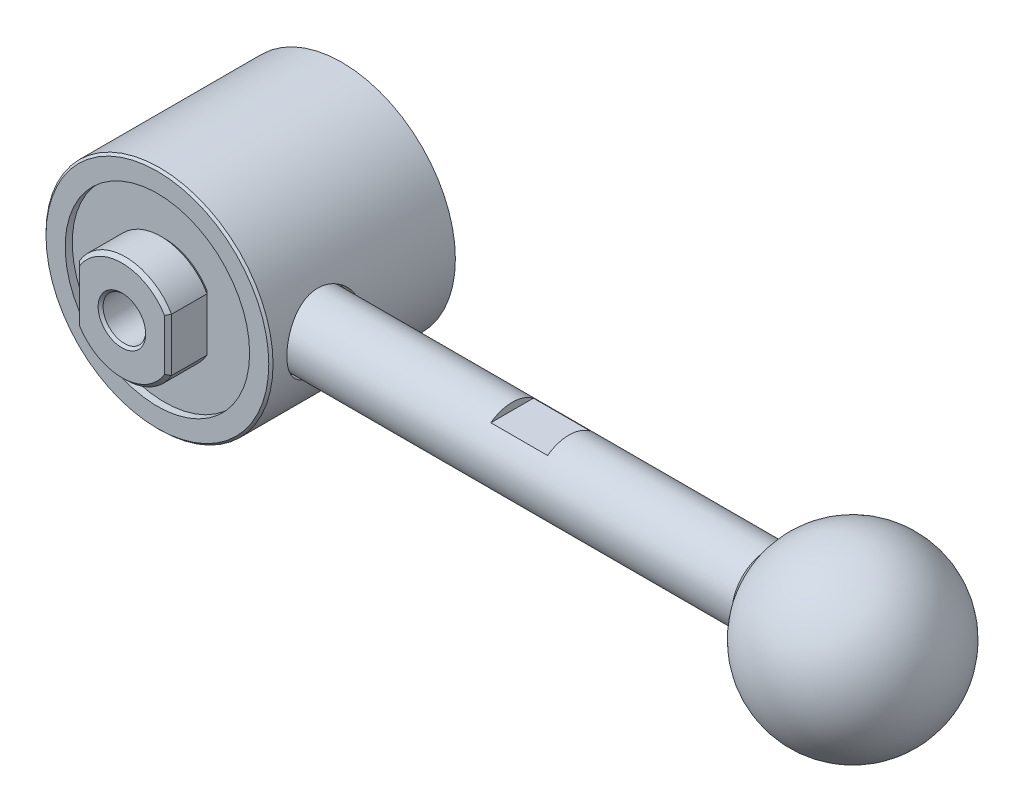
ISO-10303-21;
HEADER;
FILE_DESCRIPTION(('STEP AP214'),'2;1');
FILE_NAME('part.step','',(''),(''),'','','');
FILE_SCHEMA(('AUTOMOTIVE_DESIGN { 1 0 10303 214 1 1 1 1 }'));
ENDSEC;
DATA;
#1=APPLICATION_CONTEXT('core data for automotive mechanical design processes');
#2=APPLICATION_PROTOCOL_DEFINITION('international standard','automotive_design',2000,#1);
#3=PRODUCT_CONTEXT('',#1,'mechanical');
#4=PRODUCT('Part','Part','',(#3));
#5=PRODUCT_RELATED_PRODUCT_CATEGORY('part','',(#4));
#6=PRODUCT_DEFINITION_FORMATION('','',#4);
#7=PRODUCT_DEFINITION_CONTEXT('part definition',#1,'design');
#8=PRODUCT_DEFINITION('design','',#6,#7);
#9=PRODUCT_DEFINITION_SHAPE('','',#8);
#10=(LENGTH_UNIT() NAMED_UNIT(*) SI_UNIT(.MILLI.,.METRE.));
#11=(NAMED_UNIT(*) PLANE_ANGLE_UNIT() SI_UNIT($,.RADIAN.));
#12=(NAMED_UNIT(*) SI_UNIT($,.STERADIAN.) SOLID_ANGLE_UNIT());
#13=UNCERTAINTY_MEASURE_WITH_UNIT(LENGTH_MEASURE(1.E-05),#10,'distance_accuracy_value','');
#14=(GEOMETRIC_REPRESENTATION_CONTEXT(3) GLOBAL_UNCERTAINTY_ASSIGNED_CONTEXT((#13)) GLOBAL_UNIT_ASSIGNED_CONTEXT((#10,
#11,#12)) REPRESENTATION_CONTEXT('',''));
#15=CARTESIAN_POINT('',(0.,0.,0.));
#16=DIRECTION('',(0.,0.,1.));
#17=DIRECTION('',(1.,0.,0.));
#18=AXIS2_PLACEMENT_3D('',#15,#16,#17);
#19=CARTESIAN_POINT('',(0.,0.,3.5));
#20=DIRECTION('',(0.,0.,1.));
#21=DIRECTION('',(0.,1.,0.));
#22=AXIS2_PLACEMENT_3D('',#19,#20,#21);
#23=CYLINDRICAL_SURFACE('',#22,8.);
#24=CARTESIAN_POINT('',(0.,0.,13.5));
#25=DIRECTION('',(0.,0.,1.));
#26=DIRECTION('',(0.,1.,0.));
#27=AXIS2_PLACEMENT_3D('',#24,#25,#26);
#28=CIRCLE('',#27,8.);
#29=CARTESIAN_POINT('',(0.,8.,13.5));
#30=VERTEX_POINT('',#29);
#31=EDGE_CURVE('E331',#30,#30,#28,.T.);
#32=ORIENTED_EDGE('',*,*,#31,.T.);
#33=EDGE_LOOP('',(#32));
#34=FACE_BOUND('',#33,.T.);
#35=CARTESIAN_POINT('',(0.,0.,13.));
#36=DIRECTION('',(0.,0.,-1.));
#37=DIRECTION('',(0.,-1.,0.));
#38=AXIS2_PLACEMENT_3D('',#35,#36,#37);
#39=CIRCLE('',#38,8.);
#40=CARTESIAN_POINT('',(0.,-8.,13.));
#41=VERTEX_POINT('',#40);
#42=EDGE_CURVE('E710',#41,#41,#39,.F.);
#43=ORIENTED_EDGE('',*,*,#42,.F.);
#44=EDGE_LOOP('',(#43));
#45=FACE_BOUND('',#44,.T.);
#46=ADVANCED_FACE('F14',(#34,#45),#23,.F.);
#47=CARTESIAN_POINT('',(90.5,-3.86926253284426E-13,18.5));
#48=DIRECTION('',(0.,0.0561254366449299,0.998423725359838));
#49=DIRECTION('',(0.,-0.998423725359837,0.056125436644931));
#50=AXIS2_PLACEMENT_3D('',#47,#48,#49);
#51=SPHERICAL_SURFACE('',#50,12.5000001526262);
#52=CARTESIAN_POINT('',(90.5,-3.86926253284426E-13,18.5));
#53=DIRECTION('',(-1.,0.,0.));
#54=DIRECTION('',(0.,-0.0561254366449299,-0.998423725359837));
#55=AXIS2_PLACEMENT_3D('',#52,#53,#54);
#56=SPHERICAL_SURFACE('',#55,12.5000001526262);
#57=CARTESIAN_POINT('',(79.,-3.43049255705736E-13,18.5));
#58=DIRECTION('',(-1.,0.,0.));
#59=DIRECTION('',(0.,-0.0561254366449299,-0.998423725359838));
#60=AXIS2_PLACEMENT_3D('',#57,#58,#59);
#61=CIRCLE('',#60,4.89898);
#62=CARTESIAN_POINT('',(79.,-0.274957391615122,13.6087421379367));
#63=VERTEX_POINT('',#62);
#64=EDGE_CURVE('E24',#63,#63,#61,.T.);
#65=ORIENTED_EDGE('',*,*,#64,.F.);
#66=EDGE_LOOP('',(#65));
#67=FACE_BOUND('',#66,.T.);
#68=ADVANCED_FACE('F206',(#67),#56,.T.);
#69=CARTESIAN_POINT('',(79.,4.89125786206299,18.2250426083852));
#70=DIRECTION('',(1.,0.,0.));
#71=DIRECTION('',(0.,0.0561254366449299,0.998423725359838));
#72=AXIS2_PLACEMENT_3D('',#69,#70,#71);
#73=PLANE('',#72);
#74=CARTESIAN_POINT('',(79.,-2.94831744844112E-13,18.5));
#75=DIRECTION('',(1.,0.,0.));
#76=DIRECTION('',(0.,-1.,0.));
#77=AXIS2_PLACEMENT_3D('',#74,#75,#76);
#78=CIRCLE('',#77,4.50000000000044);
#79=CARTESIAN_POINT('',(79.,-4.50000000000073,18.5));
#80=VERTEX_POINT('',#79);
#81=EDGE_CURVE('E9',#80,#80,#78,.T.);
#82=ORIENTED_EDGE('',*,*,#81,.T.);
#83=EDGE_LOOP('',(#82));
#84=FACE_BOUND('',#83,.T.);
#85=ORIENTED_EDGE('',*,*,#64,.T.);
#86=EDGE_LOOP('',(#85));
#87=FACE_BOUND('',#86,.T.);
#88=ADVANCED_FACE('F213',(#84,#87),#73,.F.);
#89=CARTESIAN_POINT('',(0.,0.,31.));
#90=DIRECTION('',(0.,0.,1.));
#91=DIRECTION('',(0.,-1.,0.));
#92=AXIS2_PLACEMENT_3D('',#89,#90,#91);
#93=CONICAL_SURFACE('',#92,3.35,0.785398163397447);
#94=CARTESIAN_POINT('',(0.,0.,30.65));
#95=DIRECTION('',(0.,0.,1.));
#96=DIRECTION('',(-1.,0.,0.));
#97=AXIS2_PLACEMENT_3D('',#94,#95,#96);
#98=CIRCLE('',#97,3.);
#99=CARTESIAN_POINT('',(-2.99999999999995,0.,30.65));
#100=VERTEX_POINT('',#99);
#101=EDGE_CURVE('E18',#100,#100,#98,.F.);
#102=ORIENTED_EDGE('',*,*,#101,.T.);
#103=EDGE_LOOP('',(#102));
#104=FACE_BOUND('',#103,.T.);
#105=CARTESIAN_POINT('',(0.,0.,31.));
#106=DIRECTION('',(0.,0.,1.));
#107=DIRECTION('',(0.,-1.,0.));
#108=AXIS2_PLACEMENT_3D('',#105,#106,#107);
#109=CIRCLE('',#108,3.35);
#110=CARTESIAN_POINT('',(0.,-3.35,31.));
#111=VERTEX_POINT('',#110);
#112=EDGE_CURVE('E334',#111,#111,#109,.T.);
#113=ORIENTED_EDGE('',*,*,#112,.T.);
#114=EDGE_LOOP('',(#113));
#115=FACE_BOUND('',#114,.T.);
#116=ADVANCED_FACE('F231',(#104,#115),#93,.F.);
#117=CARTESIAN_POINT('',(0.,0.,-0.499999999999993));
#118=DIRECTION('',(0.,0.,1.));
#119=DIRECTION('',(0.,-1.,0.));
#120=AXIS2_PLACEMENT_3D('',#117,#118,#119);
#121=PLANE('',#120);
#122=CARTESIAN_POINT('',(0.,0.,-0.499999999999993));
#123=DIRECTION('',(0.,0.,1.));
#124=DIRECTION('',(0.,-1.,0.));
#125=AXIS2_PLACEMENT_3D('',#122,#123,#124);
#126=CIRCLE('',#125,3.5);
#127=CARTESIAN_POINT('',(0.,-3.5,-0.499999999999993));
#128=VERTEX_POINT('',#127);
#129=EDGE_CURVE('E323',#128,#128,#126,.F.);
#130=ORIENTED_EDGE('',*,*,#129,.T.);
#131=EDGE_LOOP('',(#130));
#132=FACE_BOUND('',#131,.T.);
#133=ADVANCED_FACE('F225',(#132),#121,.F.);
#134=CARTESIAN_POINT('',(0.,-7.5,31.));
#135=DIRECTION('',(0.,0.,-1.));
#136=DIRECTION('',(0.,1.,0.));
#137=AXIS2_PLACEMENT_3D('',#134,#135,#136);
#138=PLANE('',#137);
#139=ORIENTED_EDGE('',*,*,#112,.F.);
#140=EDGE_LOOP('',(#139));
#141=FACE_BOUND('',#140,.T.);
#142=CARTESIAN_POINT('',(0.,0.,31.));
#143=DIRECTION('',(0.,0.,-1.));
#144=DIRECTION('',(0.,1.,0.));
#145=AXIS2_PLACEMENT_3D('',#142,#143,#144);
#146=CIRCLE('',#145,7.);
#147=CARTESIAN_POINT('',(-6.,-3.605551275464,31.));
#148=VERTEX_POINT('',#147);
#149=CARTESIAN_POINT('',(6.,-3.60555127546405,31.));
#150=VERTEX_POINT('',#149);
#151=EDGE_CURVE('E289',#148,#150,#146,.F.);
#152=ORIENTED_EDGE('',*,*,#151,.T.);
#153=DIRECTION('',(0.,1.,0.));
#154=VECTOR('',#153,1.);
#155=CARTESIAN_POINT('',(6.,-7.5,31.));
#156=LINE('',#155,#154);
#157=CARTESIAN_POINT('',(6.00000000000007,3.605551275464,31.));
#158=VERTEX_POINT('',#157);
#159=EDGE_CURVE('E295',#150,#158,#156,.T.);
#160=ORIENTED_EDGE('',*,*,#159,.T.);
#161=CARTESIAN_POINT('',(0.,0.,31.));
#162=DIRECTION('',(0.,0.,-1.));
#163=DIRECTION('',(0.,1.,0.));
#164=AXIS2_PLACEMENT_3D('',#161,#162,#163);
#165=CIRCLE('',#164,7.);
#166=CARTESIAN_POINT('',(-5.99999999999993,3.60555127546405,31.));
#167=VERTEX_POINT('',#166);
#168=EDGE_CURVE('E293',#158,#167,#165,.F.);
#169=ORIENTED_EDGE('',*,*,#168,.T.);
#170=DIRECTION('',(0.,-1.,0.));
#171=VECTOR('',#170,1.);
#172=CARTESIAN_POINT('',(-6.,-7.5,31.));
#173=LINE('',#172,#171);
#174=EDGE_CURVE('E291',#167,#148,#173,.T.);
#175=ORIENTED_EDGE('',*,*,#174,.T.);
#176=EDGE_LOOP('',(#152,#160,#169,#175));
#177=FACE_BOUND('',#176,.T.);
#178=ADVANCED_FACE('F226',(#141,#177),#138,.F.);
#179=CARTESIAN_POINT('',(0.,0.,-0.499999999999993));
#180=DIRECTION('',(0.,0.,1.));
#181=DIRECTION('',(0.,-1.,0.));
#182=AXIS2_PLACEMENT_3D('',#179,#180,#181);
#183=CONICAL_SURFACE('',#182,3.5,0.785398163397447);
#184=CARTESIAN_POINT('',(0.,0.,1.));
#185=DIRECTION('',(0.,0.,1.));
#186=DIRECTION('',(0.,-1.,0.));
#187=AXIS2_PLACEMENT_3D('',#184,#185,#186);
#188=CIRCLE('',#187,5.);
#189=CARTESIAN_POINT('',(0.,-5.,1.));
#190=VERTEX_POINT('',#189);
#191=EDGE_CURVE('E326',#190,#190,#188,.T.);
#192=ORIENTED_EDGE('',*,*,#191,.F.);
#193=EDGE_LOOP('',(#192));
#194=FACE_BOUND('',#193,.T.);
#195=ORIENTED_EDGE('',*,*,#129,.F.);
#196=EDGE_LOOP('',(#195));
#197=FACE_BOUND('',#196,.T.);
#198=ADVANCED_FACE('F229',(#194,#197),#183,.T.);
#199=CARTESIAN_POINT('',(6.50000000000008,7.41559238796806,30.5));
#200=DIRECTION('',(-0.707106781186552,0.,-0.707106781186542));
#201=DIRECTION('',(0.707106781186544,0.,-0.70710678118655));
#202=AXIS2_PLACEMENT_3D('',#199,#200,#201);
#203=PLANE('',#202);
#204=CARTESIAN_POINT('',(6.00000000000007,3.60555127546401,31.));
#205=CARTESIAN_POINT('',(6.08327819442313,3.62864080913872,30.916721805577));
#206=CARTESIAN_POINT('',(6.16658396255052,3.65152775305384,30.8334160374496));
#207=CARTESIAN_POINT('',(6.33325062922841,3.69689645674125,30.6667493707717));
#208=CARTESIAN_POINT('',(6.41661152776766,3.71937821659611,30.5833884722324));
#209=CARTESIAN_POINT('',(6.5,3.74165738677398,30.5));
#210=B_SPLINE_CURVE_WITH_KNOTS('',3,(#204,#205,#206,#207,#208,#209),.UNSPECIFIED.,.F.,.F.,(4,2,
4),(0.,0.360043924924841,0.72008777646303),.UNSPECIFIED.);
#211=CARTESIAN_POINT('',(6.5,3.74165738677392,30.5));
#212=VERTEX_POINT('',#211);
#213=EDGE_CURVE('E393',#212,#158,#210,.F.);
#214=ORIENTED_EDGE('',*,*,#213,.T.);
#215=ORIENTED_EDGE('',*,*,#159,.F.);
#216=CARTESIAN_POINT('',(6.5,-3.74165738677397,30.5));
#217=CARTESIAN_POINT('',(6.41661152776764,-3.71937821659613,30.5833884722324));
#218=CARTESIAN_POINT('',(6.33325062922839,-3.69689645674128,30.6667493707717));
#219=CARTESIAN_POINT('',(6.16658396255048,-3.6515277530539,30.8334160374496));
#220=CARTESIAN_POINT('',(6.08327819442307,-3.62864080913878,30.916721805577));
#221=CARTESIAN_POINT('',(6.,-3.60555127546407,31.));
#222=B_SPLINE_CURVE_WITH_KNOTS('',3,(#216,#217,#218,#219,#220,#221),.UNSPECIFIED.,.F.,.F.,(4,2,
4),(0.,0.360043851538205,0.720087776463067),.UNSPECIFIED.);
#223=CARTESIAN_POINT('',(6.5,-3.74165738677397,30.5));
#224=VERTEX_POINT('',#223);
#225=EDGE_CURVE('E382',#150,#224,#222,.F.);
#226=ORIENTED_EDGE('',*,*,#225,.T.);
#227=DIRECTION('',(0.,-1.,0.));
#228=VECTOR('',#227,1.);
#229=CARTESIAN_POINT('',(6.50000000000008,7.41559238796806,30.5));
#230=LINE('',#229,#228);
#231=EDGE_CURVE('E286',#212,#224,#230,.T.);
#232=ORIENTED_EDGE('',*,*,#231,.F.);
#233=EDGE_LOOP('',(#214,#215,#226,#232));
#234=FACE_BOUND('',#233,.T.);
#235=ADVANCED_FACE('F253',(#234),#203,.F.);
#236=CARTESIAN_POINT('',(0.,0.,30.5));
#237=DIRECTION('',(0.,0.,-1.));
#238=DIRECTION('',(0.,1.,0.));
#239=AXIS2_PLACEMENT_3D('',#236,#237,#238);
#240=CONICAL_SURFACE('',#239,7.5,0.785398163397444);
#241=CARTESIAN_POINT('',(-5.99999999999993,3.60555127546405,31.));
#242=CARTESIAN_POINT('',(-6.08327819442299,3.6286408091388,30.9167218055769));
#243=CARTESIAN_POINT('',(-6.16658396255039,3.65152775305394,30.8334160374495));
#244=CARTESIAN_POINT('',(-6.33325062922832,3.69689645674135,30.6667493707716));
#245=CARTESIAN_POINT('',(-6.41661152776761,3.71937821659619,30.5833884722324));
#246=CARTESIAN_POINT('',(-6.5,3.74165738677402,30.5));
#247=B_SPLINE_CURVE_WITH_KNOTS('',3,(#241,#242,#243,#244,#245,#246),.UNSPECIFIED.,.F.,.F.,(4,2,
4),(0.,0.360043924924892,0.72008777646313),.UNSPECIFIED.);
#248=CARTESIAN_POINT('',(-6.5,3.74165738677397,30.5));
#249=VERTEX_POINT('',#248);
#250=EDGE_CURVE('E271',#249,#167,#247,.F.);
#251=ORIENTED_EDGE('',*,*,#250,.T.);
#252=ORIENTED_EDGE('',*,*,#168,.F.);
#253=ORIENTED_EDGE('',*,*,#213,.F.);
#254=CARTESIAN_POINT('',(0.,0.,30.5));
#255=DIRECTION('',(0.,0.,-1.));
#256=DIRECTION('',(0.,1.,0.));
#257=AXIS2_PLACEMENT_3D('',#254,#255,#256);
#258=CIRCLE('',#257,7.5);
#259=EDGE_CURVE('E298',#249,#212,#258,.T.);
#260=ORIENTED_EDGE('',*,*,#259,.F.);
#261=EDGE_LOOP('',(#251,#252,#253,#260));
#262=FACE_BOUND('',#261,.T.);
#263=ADVANCED_FACE('F257',(#262),#240,.T.);
#264=CARTESIAN_POINT('',(-6.49999999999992,7.41559238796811,30.5));
#265=DIRECTION('',(0.70710678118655,0.,-0.707106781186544));
#266=DIRECTION('',(0.707106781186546,0.,0.707106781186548));
#267=AXIS2_PLACEMENT_3D('',#264,#265,#266);
#268=PLANE('',#267);
#269=CARTESIAN_POINT('',(-6.,-3.60555127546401,31.));
#270=CARTESIAN_POINT('',(-6.08327819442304,-3.62864080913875,30.9167218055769));
#271=CARTESIAN_POINT('',(-6.16658396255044,-3.65152775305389,30.8334160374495));
#272=CARTESIAN_POINT('',(-6.33325062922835,-3.69689645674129,30.6667493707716));
#273=CARTESIAN_POINT('',(-6.41661152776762,-3.71937821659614,30.5833884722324));
#274=CARTESIAN_POINT('',(-6.5,-3.74165738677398,30.5));
#275=B_SPLINE_CURVE_WITH_KNOTS('',3,(#269,#270,#271,#272,#273,#274),.UNSPECIFIED.,.F.,.F.,(4,2,
4),(0.,0.360043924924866,0.720087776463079),.UNSPECIFIED.);
#276=CARTESIAN_POINT('',(-6.5,-3.74165738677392,30.5));
#277=VERTEX_POINT('',#276);
#278=EDGE_CURVE('E263',#148,#277,#275,.T.);
#279=ORIENTED_EDGE('',*,*,#278,.F.);
#280=ORIENTED_EDGE('',*,*,#174,.F.);
#281=ORIENTED_EDGE('',*,*,#250,.F.);
#282=DIRECTION('',(0.,1.,0.));
#283=VECTOR('',#282,1.);
#284=CARTESIAN_POINT('',(-6.49999999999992,7.41559238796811,30.5));
#285=LINE('',#284,#283);
#286=EDGE_CURVE('E300',#277,#249,#285,.T.);
#287=ORIENTED_EDGE('',*,*,#286,.F.);
#288=EDGE_LOOP('',(#279,#280,#281,#287));
#289=FACE_BOUND('',#288,.T.);
#290=ADVANCED_FACE('F232',(#289),#268,.F.);
#291=CARTESIAN_POINT('',(0.,0.,30.5));
#292=DIRECTION('',(0.,0.,-1.));
#293=DIRECTION('',(0.,1.,0.));
#294=AXIS2_PLACEMENT_3D('',#291,#292,#293);
#295=CONICAL_SURFACE('',#294,7.5,0.785398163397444);
#296=ORIENTED_EDGE('',*,*,#278,.T.);
#297=CARTESIAN_POINT('',(0.,0.,30.5));
#298=DIRECTION('',(0.,0.,-1.));
#299=DIRECTION('',(0.,1.,0.));
#300=AXIS2_PLACEMENT_3D('',#297,#298,#299);
#301=CIRCLE('',#300,7.5);
#302=EDGE_CURVE('E303',#224,#277,#301,.T.);
#303=ORIENTED_EDGE('',*,*,#302,.F.);
#304=ORIENTED_EDGE('',*,*,#225,.F.);
#305=ORIENTED_EDGE('',*,*,#151,.F.);
#306=EDGE_LOOP('',(#296,#303,#304,#305));
#307=FACE_BOUND('',#306,.T.);
#308=ADVANCED_FACE('F241',(#307),#295,.T.);
#309=CARTESIAN_POINT('',(0.,0.,-0.499999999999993));
#310=DIRECTION('',(0.,0.,-1.));
#311=DIRECTION('',(0.,1.,0.));
#312=AXIS2_PLACEMENT_3D('',#309,#310,#311);
#313=CYLINDRICAL_SURFACE('',#312,5.);
#314=ORIENTED_EDGE('',*,*,#191,.T.);
#315=EDGE_LOOP('',(#314));
#316=FACE_BOUND('',#315,.T.);
#317=CARTESIAN_POINT('',(0.,0.,13.5));
#318=DIRECTION('',(0.,0.,1.));
#319=DIRECTION('',(0.,1.,0.));
#320=AXIS2_PLACEMENT_3D('',#317,#318,#319);
#321=CIRCLE('',#320,5.);
#322=CARTESIAN_POINT('',(0.,5.,13.5));
#323=VERTEX_POINT('',#322);
#324=EDGE_CURVE('E165',#323,#323,#321,.T.);
#325=ORIENTED_EDGE('',*,*,#324,.F.);
#326=EDGE_LOOP('',(#325));
#327=FACE_BOUND('',#326,.T.);
#328=ADVANCED_FACE('F238',(#316,#327),#313,.T.);
#329=CARTESIAN_POINT('',(6.5,7.41559238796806,-0.5));
#330=DIRECTION('',(-1.,0.,0.));
#331=DIRECTION('',(0.,0.,-1.));
#332=AXIS2_PLACEMENT_3D('',#329,#330,#331);
#333=PLANE('',#332);
#334=DIRECTION('',(0.,0.,-1.));
#335=VECTOR('',#334,1.);
#336=CARTESIAN_POINT('',(6.5,-3.74165738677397,-0.5));
#337=LINE('',#336,#335);
#338=CARTESIAN_POINT('',(6.5,-3.74165738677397,25.5));
#339=VERTEX_POINT('',#338);
#340=EDGE_CURVE('E282',#339,#224,#337,.F.);
#341=ORIENTED_EDGE('',*,*,#340,.F.);
#342=DIRECTION('',(0.,1.,0.));
#343=VECTOR('',#342,1.);
#344=CARTESIAN_POINT('',(6.5,7.41559238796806,25.5));
#345=LINE('',#344,#343);
#346=CARTESIAN_POINT('',(6.5,3.74165738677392,25.5));
#347=VERTEX_POINT('',#346);
#348=EDGE_CURVE('E316',#339,#347,#345,.T.);
#349=ORIENTED_EDGE('',*,*,#348,.T.);
#350=DIRECTION('',(0.,0.,-1.));
#351=VECTOR('',#350,1.);
#352=CARTESIAN_POINT('',(6.5,3.74165738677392,-0.5));
#353=LINE('',#352,#351);
#354=EDGE_CURVE('E284',#212,#347,#353,.T.);
#355=ORIENTED_EDGE('',*,*,#354,.F.);
#356=ORIENTED_EDGE('',*,*,#231,.T.);
#357=EDGE_LOOP('',(#341,#349,#355,#356));
#358=FACE_BOUND('',#357,.T.);
#359=ADVANCED_FACE('F237',(#358),#333,.F.);
#360=CARTESIAN_POINT('',(0.,0.,-0.499999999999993));
#361=DIRECTION('',(0.,0.,-1.));
#362=DIRECTION('',(0.,1.,0.));
#363=AXIS2_PLACEMENT_3D('',#360,#361,#362);
#364=CYLINDRICAL_SURFACE('',#363,7.5);
#365=ORIENTED_EDGE('',*,*,#354,.T.);
#366=CARTESIAN_POINT('',(0.,0.,25.5));
#367=DIRECTION('',(0.,0.,1.));
#368=DIRECTION('',(0.,-1.,0.));
#369=AXIS2_PLACEMENT_3D('',#366,#367,#368);
#370=CIRCLE('',#369,7.5);
#371=CARTESIAN_POINT('',(-6.5,3.74165738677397,25.5));
#372=VERTEX_POINT('',#371);
#373=EDGE_CURVE('E85',#347,#372,#370,.T.);
#374=ORIENTED_EDGE('',*,*,#373,.T.);
#375=DIRECTION('',(0.,0.,-1.));
#376=VECTOR('',#375,1.);
#377=CARTESIAN_POINT('',(-6.5,3.74165738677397,-0.499999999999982));
#378=LINE('',#377,#376);
#379=EDGE_CURVE('E278',#372,#249,#378,.F.);
#380=ORIENTED_EDGE('',*,*,#379,.T.);
#381=ORIENTED_EDGE('',*,*,#259,.T.);
#382=EDGE_LOOP('',(#365,#374,#380,#381));
#383=FACE_BOUND('',#382,.T.);
#384=ADVANCED_FACE('F233',(#383),#364,.T.);
#385=CARTESIAN_POINT('',(-6.5,7.41559238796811,-0.499999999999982));
#386=DIRECTION('',(1.,0.,0.));
#387=DIRECTION('',(0.,0.,1.));
#388=AXIS2_PLACEMENT_3D('',#385,#386,#387);
#389=PLANE('',#388);
#390=ORIENTED_EDGE('',*,*,#379,.F.);
#391=DIRECTION('',(0.,-1.,0.));
#392=VECTOR('',#391,1.);
#393=CARTESIAN_POINT('',(-6.49999999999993,7.41559238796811,25.5));
#394=LINE('',#393,#392);
#395=CARTESIAN_POINT('',(-6.5,-3.74165738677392,25.5));
#396=VERTEX_POINT('',#395);
#397=EDGE_CURVE('E92',#372,#396,#394,.T.);
#398=ORIENTED_EDGE('',*,*,#397,.T.);
#399=DIRECTION('',(0.,0.,-1.));
#400=VECTOR('',#399,1.);
#401=CARTESIAN_POINT('',(-6.5,-3.74165738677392,-0.499999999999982));
#402=LINE('',#401,#400);
#403=EDGE_CURVE('E280',#277,#396,#402,.T.);
#404=ORIENTED_EDGE('',*,*,#403,.F.);
#405=ORIENTED_EDGE('',*,*,#286,.T.);
#406=EDGE_LOOP('',(#390,#398,#404,#405));
#407=FACE_BOUND('',#406,.T.);
#408=ADVANCED_FACE('F236',(#407),#389,.F.);
#409=ORIENTED_EDGE('',*,*,#403,.T.);
#410=CARTESIAN_POINT('',(0.,0.,25.5));
#411=DIRECTION('',(0.,0.,1.));
#412=DIRECTION('',(0.,-1.,0.));
#413=AXIS2_PLACEMENT_3D('',#410,#411,#412);
#414=CIRCLE('',#413,7.5);
#415=EDGE_CURVE('E321',#396,#339,#414,.T.);
#416=ORIENTED_EDGE('',*,*,#415,.T.);
#417=ORIENTED_EDGE('',*,*,#340,.T.);
#418=ORIENTED_EDGE('',*,*,#302,.T.);
#419=EDGE_LOOP('',(#409,#416,#417,#418));
#420=FACE_BOUND('',#419,.T.);
#421=ADVANCED_FACE('F222',(#420),#364,.T.);
#422=CARTESIAN_POINT('',(0.,0.,13.5));
#423=DIRECTION('',(0.,0.,1.));
#424=DIRECTION('',(0.,1.,0.));
#425=AXIS2_PLACEMENT_3D('',#422,#423,#424);
#426=PLANE('',#425);
#427=ORIENTED_EDGE('',*,*,#31,.F.);
#428=EDGE_LOOP('',(#427));
#429=FACE_BOUND('',#428,.T.);
#430=ORIENTED_EDGE('',*,*,#324,.T.);
#431=EDGE_LOOP('',(#430));
#432=FACE_BOUND('',#431,.T.);
#433=ADVANCED_FACE('F219',(#429,#432),#426,.F.);
#434=CARTESIAN_POINT('',(6.,-4.5,25.));
#435=DIRECTION('',(-0.707106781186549,0.,0.707106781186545));
#436=DIRECTION('',(-0.707106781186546,0.,-0.707106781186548));
#437=AXIS2_PLACEMENT_3D('',#434,#435,#436);
#438=PLANE('',#437);
#439=CARTESIAN_POINT('',(6.5,3.74165738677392,25.5));
#440=CARTESIAN_POINT('',(6.41661152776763,3.71937821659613,25.4166115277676));
#441=CARTESIAN_POINT('',(6.33325062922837,3.69689645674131,25.3332506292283));
#442=CARTESIAN_POINT('',(6.16658396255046,3.65152775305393,25.1665839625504));
#443=CARTESIAN_POINT('',(6.08327819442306,3.62864080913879,25.083278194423));
#444=CARTESIAN_POINT('',(6.,3.60555127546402,25.));
#445=B_SPLINE_CURVE_WITH_KNOTS('',3,(#439,#440,#441,#442,#443,#444),.UNSPECIFIED.,.F.,.F.,(4,2,
4),(0.,0.360043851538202,0.720087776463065),.UNSPECIFIED.);
#446=CARTESIAN_POINT('',(6.,3.605551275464,25.));
#447=VERTEX_POINT('',#446);
#448=EDGE_CURVE('E343',#447,#347,#445,.F.);
#449=ORIENTED_EDGE('',*,*,#448,.T.);
#450=ORIENTED_EDGE('',*,*,#348,.F.);
#451=CARTESIAN_POINT('',(6.,-3.60555127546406,25.));
#452=CARTESIAN_POINT('',(6.08327819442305,-3.62864080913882,25.0832781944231));
#453=CARTESIAN_POINT('',(6.16658396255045,-3.65152775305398,25.1665839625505));
#454=CARTESIAN_POINT('',(6.33325062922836,-3.69689645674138,25.3332506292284));
#455=CARTESIAN_POINT('',(6.41661152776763,-3.71937821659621,25.4166115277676));
#456=CARTESIAN_POINT('',(6.5,-3.74165738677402,25.5));
#457=B_SPLINE_CURVE_WITH_KNOTS('',3,(#451,#452,#453,#454,#455,#456),.UNSPECIFIED.,.F.,.F.,(4,2,
4),(0.,0.360043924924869,0.720087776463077),.UNSPECIFIED.);
#458=CARTESIAN_POINT('',(6.,-3.60555127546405,25.));
#459=VERTEX_POINT('',#458);
#460=EDGE_CURVE('E338',#339,#459,#457,.F.);
#461=ORIENTED_EDGE('',*,*,#460,.T.);
#462=DIRECTION('',(0.,-1.,0.));
#463=VECTOR('',#462,1.);
#464=CARTESIAN_POINT('',(6.,-4.5,25.));
#465=LINE('',#464,#463);
#466=EDGE_CURVE('E313',#447,#459,#465,.T.);
#467=ORIENTED_EDGE('',*,*,#466,.F.);
#468=EDGE_LOOP('',(#449,#450,#461,#467));
#469=FACE_BOUND('',#468,.T.);
#470=ADVANCED_FACE('F190',(#469),#438,.F.);
#471=CARTESIAN_POINT('',(0.,0.,25.));
#472=DIRECTION('',(0.,0.,1.));
#473=DIRECTION('',(0.,-1.,0.));
#474=AXIS2_PLACEMENT_3D('',#471,#472,#473);
#475=CONICAL_SURFACE('',#474,7.,0.785398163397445);
#476=CARTESIAN_POINT('',(-6.5,3.74165738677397,25.5));
#477=CARTESIAN_POINT('',(-6.41661152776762,3.71937821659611,25.4166115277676));
#478=CARTESIAN_POINT('',(-6.33325062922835,3.69689645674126,25.3332506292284));
#479=CARTESIAN_POINT('',(-6.16658396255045,3.65152775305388,25.1665839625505));
#480=CARTESIAN_POINT('',(-6.08327819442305,3.62864080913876,25.0832781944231));
#481=CARTESIAN_POINT('',(-6.,3.60555127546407,25.));
#482=B_SPLINE_CURVE_WITH_KNOTS('',3,(#476,#477,#478,#479,#480,#481),.UNSPECIFIED.,.F.,.F.,(4,2,
4),(0.,0.360043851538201,0.720087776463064),.UNSPECIFIED.);
#483=CARTESIAN_POINT('',(-6.,3.60555127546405,25.));
#484=VERTEX_POINT('',#483);
#485=EDGE_CURVE('E375',#484,#372,#482,.F.);
#486=ORIENTED_EDGE('',*,*,#485,.T.);
#487=ORIENTED_EDGE('',*,*,#373,.F.);
#488=ORIENTED_EDGE('',*,*,#448,.F.);
#489=CARTESIAN_POINT('',(0.,0.,25.));
#490=DIRECTION('',(0.,0.,1.));
#491=DIRECTION('',(0.,-1.,0.));
#492=AXIS2_PLACEMENT_3D('',#489,#490,#491);
#493=CIRCLE('',#492,7.);
#494=EDGE_CURVE('E310',#484,#447,#493,.F.);
#495=ORIENTED_EDGE('',*,*,#494,.F.);
#496=EDGE_LOOP('',(#486,#487,#488,#495));
#497=FACE_BOUND('',#496,.T.);
#498=ADVANCED_FACE('F250',(#497),#475,.T.);
#499=CARTESIAN_POINT('',(-6.,-4.5,25.));
#500=DIRECTION('',(0.707106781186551,0.,0.707106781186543));
#501=DIRECTION('',(-0.707106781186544,0.,0.70710678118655));
#502=AXIS2_PLACEMENT_3D('',#499,#500,#501);
#503=PLANE('',#502);
#504=CARTESIAN_POINT('',(-6.5,-3.74165738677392,25.5));
#505=CARTESIAN_POINT('',(-6.41661152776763,-3.71937821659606,25.4166115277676));
#506=CARTESIAN_POINT('',(-6.33325062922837,-3.6968964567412,25.3332506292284));
#507=CARTESIAN_POINT('',(-6.16658396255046,-3.65152775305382,25.1665839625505));
#508=CARTESIAN_POINT('',(-6.08327819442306,-3.62864080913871,25.0832781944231));
#509=CARTESIAN_POINT('',(-6.,-3.60555127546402,25.));
#510=B_SPLINE_CURVE_WITH_KNOTS('',3,(#504,#505,#506,#507,#508,#509),.UNSPECIFIED.,.F.,.F.,(4,2,
4),(0.,0.360043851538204,0.720087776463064),.UNSPECIFIED.);
#511=CARTESIAN_POINT('',(-6.,-3.605551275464,25.));
#512=VERTEX_POINT('',#511);
#513=EDGE_CURVE('E383',#396,#512,#510,.T.);
#514=ORIENTED_EDGE('',*,*,#513,.F.);
#515=ORIENTED_EDGE('',*,*,#397,.F.);
#516=ORIENTED_EDGE('',*,*,#485,.F.);
#517=DIRECTION('',(0.,1.,0.));
#518=VECTOR('',#517,1.);
#519=CARTESIAN_POINT('',(-6.,-4.5,25.));
#520=LINE('',#519,#518);
#521=EDGE_CURVE('E308',#512,#484,#520,.T.);
#522=ORIENTED_EDGE('',*,*,#521,.F.);
#523=EDGE_LOOP('',(#514,#515,#516,#522));
#524=FACE_BOUND('',#523,.T.);
#525=ADVANCED_FACE('F370',(#524),#503,.F.);
#526=CARTESIAN_POINT('',(0.,0.,25.));
#527=DIRECTION('',(0.,0.,1.));
#528=DIRECTION('',(0.,-1.,0.));
#529=AXIS2_PLACEMENT_3D('',#526,#527,#528);
#530=CONICAL_SURFACE('',#529,7.,0.785398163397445);
#531=ORIENTED_EDGE('',*,*,#513,.T.);
#532=CARTESIAN_POINT('',(0.,0.,25.));
#533=DIRECTION('',(0.,0.,1.));
#534=DIRECTION('',(0.,-1.,0.));
#535=AXIS2_PLACEMENT_3D('',#532,#533,#534);
#536=CIRCLE('',#535,7.);
#537=EDGE_CURVE('E305',#459,#512,#536,.F.);
#538=ORIENTED_EDGE('',*,*,#537,.F.);
#539=ORIENTED_EDGE('',*,*,#460,.F.);
#540=ORIENTED_EDGE('',*,*,#415,.F.);
#541=EDGE_LOOP('',(#531,#538,#539,#540));
#542=FACE_BOUND('',#541,.T.);
#543=ADVANCED_FACE('F249',(#542),#530,.T.);
#544=CARTESIAN_POINT('',(0.,0.,25.));
#545=DIRECTION('',(0.,0.,1.));
#546=DIRECTION('',(0.,1.,0.));
#547=AXIS2_PLACEMENT_3D('',#544,#545,#546);
#548=PLANE('',#547);
#549=ORIENTED_EDGE('',*,*,#537,.T.);
#550=ORIENTED_EDGE('',*,*,#521,.T.);
#551=ORIENTED_EDGE('',*,*,#494,.T.);
#552=ORIENTED_EDGE('',*,*,#466,.T.);
#553=EDGE_LOOP('',(#549,#550,#551,#552));
#554=FACE_BOUND('',#553,.T.);
#555=CARTESIAN_POINT('',(0.,0.,25.));
#556=DIRECTION('',(0.,0.,1.));
#557=DIRECTION('',(1.,0.,0.));
#558=AXIS2_PLACEMENT_3D('',#555,#556,#557);
#559=CIRCLE('',#558,13.);
#560=CARTESIAN_POINT('',(13.,0.,25.));
#561=VERTEX_POINT('',#560);
#562=EDGE_CURVE('E696',#561,#561,#559,.T.);
#563=ORIENTED_EDGE('',*,*,#562,.T.);
#564=EDGE_LOOP('',(#563));
#565=FACE_BOUND('',#564,.T.);
#566=ADVANCED_FACE('F16',(#554,#565),#548,.T.);
#567=CARTESIAN_POINT('',(0.,0.,26.));
#568=DIRECTION('',(0.,0.,1.));
#569=DIRECTION('',(1.,0.,0.));
#570=AXIS2_PLACEMENT_3D('',#567,#568,#569);
#571=CYLINDRICAL_SURFACE('',#570,13.);
#572=ORIENTED_EDGE('',*,*,#562,.F.);
#573=EDGE_LOOP('',(#572));
#574=FACE_BOUND('',#573,.T.);
#575=CARTESIAN_POINT('',(0.,0.,26.));
#576=DIRECTION('',(0.,0.,1.));
#577=DIRECTION('',(1.,0.,0.));
#578=AXIS2_PLACEMENT_3D('',#575,#576,#577);
#579=CIRCLE('',#578,13.);
#580=CARTESIAN_POINT('',(13.,0.,26.));
#581=VERTEX_POINT('',#580);
#582=EDGE_CURVE('E164',#581,#581,#579,.T.);
#583=ORIENTED_EDGE('',*,*,#582,.T.);
#584=EDGE_LOOP('',(#583));
#585=FACE_BOUND('',#584,.T.);
#586=ADVANCED_FACE('F186',(#574,#585),#571,.F.);
#587=CARTESIAN_POINT('',(0.,0.,26.));
#588=DIRECTION('',(0.,0.,1.));
#589=DIRECTION('',(1.,0.,0.));
#590=AXIS2_PLACEMENT_3D('',#587,#588,#589);
#591=CYLINDRICAL_SURFACE('',#590,15.);
#592=CARTESIAN_POINT('',(0.,0.,13.));
#593=DIRECTION('',(0.,0.,-1.));
#594=DIRECTION('',(0.,-1.,0.));
#595=AXIS2_PLACEMENT_3D('',#592,#593,#594);
#596=CIRCLE('',#595,15.);
#597=CARTESIAN_POINT('',(0.,-15.,13.));
#598=VERTEX_POINT('',#597);
#599=EDGE_CURVE('E712',#598,#598,#596,.T.);
#600=ORIENTED_EDGE('',*,*,#599,.F.);
#601=EDGE_LOOP('',(#600));
#602=FACE_BOUND('',#601,.T.);
#603=CARTESIAN_POINT('',(0.,0.,0.));
#604=DIRECTION('',(0.,0.,1.));
#605=DIRECTION('',(1.,0.,0.));
#606=AXIS2_PLACEMENT_3D('',#603,#604,#605);
#607=CIRCLE('',#606,15.);
#608=CARTESIAN_POINT('',(15.,0.,0.));
#609=VERTEX_POINT('',#608);
#610=EDGE_CURVE('E692',#609,#609,#607,.T.);
#611=ORIENTED_EDGE('',*,*,#610,.F.);
#612=EDGE_LOOP('',(#611));
#613=FACE_BOUND('',#612,.T.);
#614=ADVANCED_FACE('F184',(#602,#613),#591,.F.);
#615=CARTESIAN_POINT('',(1.08595760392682E-13,16.,26.));
#616=DIRECTION('',(0.,0.,-1.));
#617=DIRECTION('',(-1.,0.,0.));
#618=AXIS2_PLACEMENT_3D('',#615,#616,#617);
#619=PLANE('',#618);
#620=CARTESIAN_POINT('',(0.,0.,26.));
#621=DIRECTION('',(0.,0.,-1.));
#622=DIRECTION('',(-1.,0.,0.));
#623=AXIS2_PLACEMENT_3D('',#620,#621,#622);
#624=CIRCLE('',#623,15.7);
#625=CARTESIAN_POINT('',(-15.7,0.,26.));
#626=VERTEX_POINT('',#625);
#627=EDGE_CURVE('E686',#626,#626,#624,.F.);
#628=ORIENTED_EDGE('',*,*,#627,.T.);
#629=EDGE_LOOP('',(#628));
#630=FACE_BOUND('',#629,.T.);
#631=ORIENTED_EDGE('',*,*,#582,.F.);
#632=EDGE_LOOP('',(#631));
#633=FACE_BOUND('',#632,.T.);
#634=ADVANCED_FACE('F178',(#630,#633),#619,.F.);
#635=CARTESIAN_POINT('',(0.,16.,0.));
#636=DIRECTION('',(0.,0.,1.));
#637=DIRECTION('',(1.,0.,0.));
#638=AXIS2_PLACEMENT_3D('',#635,#636,#637);
#639=PLANE('',#638);
#640=CARTESIAN_POINT('',(0.,0.,0.));
#641=DIRECTION('',(0.,0.,1.));
#642=DIRECTION('',(1.,0.,0.));
#643=AXIS2_PLACEMENT_3D('',#640,#641,#642);
#644=CIRCLE('',#643,16.);
#645=CARTESIAN_POINT('',(16.,0.,0.));
#646=VERTEX_POINT('',#645);
#647=EDGE_CURVE('E689',#646,#646,#644,.T.);
#648=ORIENTED_EDGE('',*,*,#647,.F.);
#649=EDGE_LOOP('',(#648));
#650=FACE_BOUND('',#649,.T.);
#651=ORIENTED_EDGE('',*,*,#610,.T.);
#652=EDGE_LOOP('',(#651));
#653=FACE_BOUND('',#652,.T.);
#654=ADVANCED_FACE('F183',(#650,#653),#639,.F.);
#655=CARTESIAN_POINT('',(0.,0.,26.));
#656=DIRECTION('',(0.,0.,-1.));
#657=DIRECTION('',(-1.,0.,0.));
#658=AXIS2_PLACEMENT_3D('',#655,#656,#657);
#659=CONICAL_SURFACE('',#658,15.7,0.785398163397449);
#660=CARTESIAN_POINT('',(0.,0.,25.7));
#661=DIRECTION('',(0.,0.,-1.));
#662=DIRECTION('',(-1.,0.,0.));
#663=AXIS2_PLACEMENT_3D('',#660,#661,#662);
#664=CIRCLE('',#663,16.);
#665=CARTESIAN_POINT('',(-16.,0.,25.7));
#666=VERTEX_POINT('',#665);
#667=EDGE_CURVE('E346',#666,#666,#664,.T.);
#668=ORIENTED_EDGE('',*,*,#667,.F.);
#669=EDGE_LOOP('',(#668));
#670=FACE_BOUND('',#669,.T.);
#671=ORIENTED_EDGE('',*,*,#627,.F.);
#672=EDGE_LOOP('',(#671));
#673=FACE_BOUND('',#672,.T.);
#674=ADVANCED_FACE('F179',(#670,#673),#659,.T.);
#675=CARTESIAN_POINT('',(0.,0.,26.));
#676=DIRECTION('',(0.,0.,1.));
#677=DIRECTION('',(1.,0.,0.));
#678=AXIS2_PLACEMENT_3D('',#675,#676,#677);
#679=CYLINDRICAL_SURFACE('',#678,16.);
#680=ORIENTED_EDGE('',*,*,#667,.T.);
#681=EDGE_LOOP('',(#680));
#682=FACE_BOUND('',#681,.T.);
#683=CARTESIAN_POINT('',(16.,0.,13.25));
#684=CARTESIAN_POINT('',(16.0000001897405,-0.286709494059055,13.2499994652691));
#685=CARTESIAN_POINT('',(15.9922220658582,-0.573418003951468,13.2735628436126));
#686=CARTESIAN_POINT('',(15.9619585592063,-1.13840576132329,13.3669169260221));
#687=CARTESIAN_POINT('',(15.9394711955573,-1.41668386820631,13.4367138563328));
#688=CARTESIAN_POINT('',(15.8822364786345,-1.95658170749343,13.6198923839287));
#689=CARTESIAN_POINT('',(15.8475092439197,-2.21822794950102,13.7332024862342));
#690=CARTESIAN_POINT('',(15.7693480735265,-2.71880895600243,13.9998850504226));
#691=CARTESIAN_POINT('',(15.7259125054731,-2.95773945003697,14.15326502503));
#692=CARTESIAN_POINT('',(15.6332861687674,-3.41412925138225,14.5011154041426));
#693=CARTESIAN_POINT('',(15.5839607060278,-3.63071644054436,14.6966919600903));
#694=CARTESIAN_POINT('',(15.4858403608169,-4.0287523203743,15.1212095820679));
#695=CARTESIAN_POINT('',(15.4370455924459,-4.21019359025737,15.3501576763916));
#696=CARTESIAN_POINT('',(15.3676517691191,-4.45451830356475,15.7175027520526));
#697=CARTESIAN_POINT('',(15.3448664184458,-4.53219011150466,15.8458879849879));
#698=CARTESIAN_POINT('',(15.301536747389,-4.67639137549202,16.1091118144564));
#699=CARTESIAN_POINT('',(15.2809915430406,-4.74292523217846,16.2439478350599));
#700=CARTESIAN_POINT('',(15.2427851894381,-4.86431443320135,16.5191964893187));
#701=CARTESIAN_POINT('',(15.2251245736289,-4.91916761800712,16.6596101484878));
#702=CARTESIAN_POINT('',(15.1932765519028,-5.01667019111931,16.9449330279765));
#703=CARTESIAN_POINT('',(15.1790875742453,-5.05932510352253,17.0898401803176));
#704=CARTESIAN_POINT('',(15.1550519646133,-5.13086527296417,17.37835336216));
#705=CARTESIAN_POINT('',(15.1450795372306,-5.16015188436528,17.521849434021));
#706=CARTESIAN_POINT('',(15.1291596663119,-5.2066432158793,17.8109495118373));
#707=CARTESIAN_POINT('',(15.123210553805,-5.22385294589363,17.9565526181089));
#708=CARTESIAN_POINT('',(15.1155308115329,-5.24603342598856,18.248790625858));
#709=CARTESIAN_POINT('',(15.1137999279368,-5.25100491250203,18.3954254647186));
#710=CARTESIAN_POINT('',(15.1146148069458,-5.24865901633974,18.6885827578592));
#711=CARTESIAN_POINT('',(15.1171604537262,-5.24134196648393,18.8351052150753));
#712=CARTESIAN_POINT('',(15.1262351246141,-5.21509263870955,19.1204141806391));
#713=CARTESIAN_POINT('',(15.1325824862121,-5.19668986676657,19.2592555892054));
#714=CARTESIAN_POINT('',(15.1489112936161,-5.14889539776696,19.5348641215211));
#715=CARTESIAN_POINT('',(15.1588939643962,-5.11949999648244,19.671630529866));
#716=CARTESIAN_POINT('',(15.1821914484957,-5.04999045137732,19.9420764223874));
#717=CARTESIAN_POINT('',(15.1955053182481,-5.0098793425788,20.0757567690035));
#718=CARTESIAN_POINT('',(15.2250851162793,-4.91925343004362,20.3392574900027));
#719=CARTESIAN_POINT('',(15.2413521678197,-4.86873466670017,20.469076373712));
#720=CARTESIAN_POINT('',(15.2766495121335,-4.75683410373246,20.7259719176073));
#721=CARTESIAN_POINT('',(15.2957183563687,-4.69529758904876,20.8529759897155));
#722=CARTESIAN_POINT('',(15.3358955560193,-4.56236027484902,21.1013928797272));
#723=CARTESIAN_POINT('',(15.3570046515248,-4.49095589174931,21.2228036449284));
#724=CARTESIAN_POINT('',(15.422542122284,-4.26265776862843,21.5775304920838));
#725=CARTESIAN_POINT('',(15.4692078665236,-4.09159662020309,21.8015294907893));
#726=CARTESIAN_POINT('',(15.5660589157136,-3.70662777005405,22.2296799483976));
#727=CARTESIAN_POINT('',(15.6163029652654,-3.49099291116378,22.4322584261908));
#728=CARTESIAN_POINT('',(15.7126062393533,-3.02816716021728,22.798813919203));
#729=CARTESIAN_POINT('',(15.758665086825,-2.78097342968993,22.9627874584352));
#730=CARTESIAN_POINT('',(15.8419744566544,-2.25882664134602,23.2486414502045));
#731=CARTESIAN_POINT('',(15.8791385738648,-1.98363559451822,23.3701139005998));
#732=CARTESIAN_POINT('',(15.9398466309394,-1.41521430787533,23.5645637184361));
#733=CARTESIAN_POINT('',(15.9633951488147,-1.12199016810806,23.6375573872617));
#734=CARTESIAN_POINT('',(15.9934654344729,-0.539099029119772,23.7302264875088));
#735=CARTESIAN_POINT('',(16.0006630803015,-0.24980309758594,23.7520197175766));
#736=CARTESIAN_POINT('',(15.9992404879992,0.328362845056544,23.747686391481));
#737=CARTESIAN_POINT('',(15.990622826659,0.617232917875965,23.7215676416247));
#738=CARTESIAN_POINT('',(15.958984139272,1.17794733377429,23.6238366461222));
#739=CARTESIAN_POINT('',(15.9363716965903,1.45004183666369,23.5535140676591));
#740=CARTESIAN_POINT('',(15.8794304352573,1.978476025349,23.3709640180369));
#741=CARTESIAN_POINT('',(15.8451001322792,2.23481371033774,23.2587312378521));
#742=CARTESIAN_POINT('',(15.7671241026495,2.73180727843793,22.9923622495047));
#743=CARTESIAN_POINT('',(15.7232605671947,2.97188670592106,22.8372180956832));
#744=CARTESIAN_POINT('',(15.6311726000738,3.42338661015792,22.4904754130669));
#745=CARTESIAN_POINT('',(15.5829468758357,3.63479854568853,22.2988660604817));
#746=CARTESIAN_POINT('',(15.5099889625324,3.93080686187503,21.9832982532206));
#747=CARTESIAN_POINT('',(15.4850337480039,4.0277565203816,21.8707214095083));
#748=CARTESIAN_POINT('',(15.435978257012,4.21184399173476,21.6376565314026));
#749=CARTESIAN_POINT('',(15.4118776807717,4.29898526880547,21.5171713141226));
#750=CARTESIAN_POINT('',(15.365217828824,4.46288622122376,21.2689852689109));
#751=CARTESIAN_POINT('',(15.3426592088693,4.53964149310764,21.1412814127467));
#752=CARTESIAN_POINT('',(15.2997778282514,4.68212907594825,20.8795698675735));
#753=CARTESIAN_POINT('',(15.2794541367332,4.74786598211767,20.7455648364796));
#754=CARTESIAN_POINT('',(15.2417045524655,4.86768768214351,20.4723882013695));
#755=CARTESIAN_POINT('',(15.2242726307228,4.92179679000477,20.3332281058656));
#756=CARTESIAN_POINT('',(15.1928226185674,5.01803804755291,20.0505099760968));
#757=CARTESIAN_POINT('',(15.1788031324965,5.06017509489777,19.9069537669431));
#758=CARTESIAN_POINT('',(15.1546390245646,5.1320909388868,19.6164790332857));
#759=CARTESIAN_POINT('',(15.1444937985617,5.16187166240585,19.4695610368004));
#760=CARTESIAN_POINT('',(15.1284251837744,5.20877809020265,19.1734921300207));
#761=CARTESIAN_POINT('',(15.1225015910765,5.22590440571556,19.0243413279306));
#762=CARTESIAN_POINT('',(15.1152688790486,5.24678567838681,18.7325064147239));
#763=CARTESIAN_POINT('',(15.1137437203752,5.25116674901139,18.5898721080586));
#764=CARTESIAN_POINT('',(15.1147381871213,5.24830378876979,18.304683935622));
#765=CARTESIAN_POINT('',(15.1172591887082,5.24105580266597,18.1621301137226));
#766=CARTESIAN_POINT('',(15.1262661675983,5.21500339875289,17.8782731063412));
#767=CARTESIAN_POINT('',(15.1327504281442,5.19620398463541,17.7369694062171));
#768=CARTESIAN_POINT('',(15.1494797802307,5.14722550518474,17.4565239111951));
#769=CARTESIAN_POINT('',(15.1597262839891,5.11704216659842,17.3173829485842));
#770=CARTESIAN_POINT('',(15.1834458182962,5.04622046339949,17.0447960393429));
#771=CARTESIAN_POINT('',(15.1968565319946,5.00578302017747,16.9112924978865));
#772=CARTESIAN_POINT('',(15.2266068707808,4.91454331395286,16.6481951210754));
#773=CARTESIAN_POINT('',(15.2429475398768,4.8637373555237,16.5186026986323));
#774=CARTESIAN_POINT('',(15.2956907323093,4.69633894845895,16.1369666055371));
#775=CARTESIAN_POINT('',(15.335834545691,4.56470890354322,15.8918461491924));
#776=CARTESIAN_POINT('',(15.4236656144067,4.2587363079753,15.416320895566));
#777=CARTESIAN_POINT('',(15.4716009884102,4.0828159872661,15.1869845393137));
#778=CARTESIAN_POINT('',(15.5685600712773,3.69589864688,14.7602430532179));
#779=CARTESIAN_POINT('',(15.6175840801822,3.48489185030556,14.562846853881));
#780=CARTESIAN_POINT('',(15.7133890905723,3.0243467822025,14.1982256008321));
#781=CARTESIAN_POINT('',(15.7600181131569,2.7736644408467,14.0324013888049));
#782=CARTESIAN_POINT('',(15.8437522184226,2.24646513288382,13.7454351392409));
#783=CARTESIAN_POINT('',(15.8808600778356,1.96995573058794,13.6242800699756));
#784=CARTESIAN_POINT('',(15.9396537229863,1.41459012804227,13.4361463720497));
#785=CARTESIAN_POINT('',(15.9620741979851,1.13669576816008,13.3665591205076));
#786=CARTESIAN_POINT('',(15.9922453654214,0.572532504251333,13.2734920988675));
#787=CARTESIAN_POINT('',(15.9999998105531,0.286265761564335,13.2500005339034));
#788=CARTESIAN_POINT('',(16.,0.,13.25));
#789=B_SPLINE_CURVE_WITH_KNOTS('',3,(#683,#684,#685,#686,#687,#688,#689,#690,#691,#692,#693,
#694,#695,#696,#697,#698,#699,#700,#701,#702,#703,#704,#705,#706,#707,#708,#709,#710,#711,#712,
#713,#714,#715,#716,#717,#718,#719,#720,#721,#722,#723,#724,#725,#726,#727,#728,#729,#730,#731,
#732,#733,#734,#735,#736,#737,#738,#739,#740,#741,#742,#743,#744,#745,#746,#747,#748,#749,#750,
#751,#752,#753,#754,#755,#756,#757,#758,#759,#760,#761,#762,#763,#764,#765,#766,#767,#768,#769,
#770,#771,#772,#773,#774,#775,#776,#777,#778,#779,#780,#781,#782,#783,#784,#785,#786,#787,#788),
.UNSPECIFIED.,.T.,.F.,(4,2,2,2,2,2,2,2,2,2,2,2,2,2,2,2,2,2,2,2,2,2,2,2,2,2,2,2,2,2,2,2,2,2,2,2,
2,2,2,2,2,2,2,2,2,2,2,2,2,2,2,2,4),(0.,0.859075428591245,1.71826657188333,2.57605200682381,
3.43399838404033,4.31799257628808,5.2021732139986,5.65702442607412,6.11169549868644,
6.56645055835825,7.02099935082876,7.46082097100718,7.90046003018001,8.34007263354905,
8.77967333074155,9.19977850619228,9.62002537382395,10.0401533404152,10.4604414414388,
10.8871751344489,11.3140642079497,12.1672273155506,13.0634636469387,13.9597806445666,
14.8644801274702,15.7688752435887,16.6351478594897,17.5012793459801,18.3432445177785,
19.1853163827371,20.0491497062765,20.9132398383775,21.3647510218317,21.8161022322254,
22.2676442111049,22.718997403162,23.1693974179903,23.6196129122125,24.0697581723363,
24.5198816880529,24.9474850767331,25.375233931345,25.8027976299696,26.2305219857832,
26.6504379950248,27.0705039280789,27.9099651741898,28.7851100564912,29.6604992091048,
30.5685564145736,31.476348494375,32.3343139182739,33.1920597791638),.UNSPECIFIED.);
#790=CARTESIAN_POINT('',(16.,0.,13.25));
#791=VERTEX_POINT('',#790);
#792=EDGE_CURVE('E156',#791,#791,#789,.T.);
#793=ORIENTED_EDGE('',*,*,#792,.T.);
#794=EDGE_LOOP('',(#793));
#795=FACE_BOUND('',#794,.T.);
#796=ORIENTED_EDGE('',*,*,#647,.T.);
#797=EDGE_LOOP('',(#796));
#798=FACE_BOUND('',#797,.T.);
#799=ADVANCED_FACE('F167',(#682,#795,#798),#679,.T.);
#800=CARTESIAN_POINT('',(6.,0.,18.5));
#801=DIRECTION('',(1.,0.,0.));
#802=DIRECTION('',(0.,0.,-1.));
#803=AXIS2_PLACEMENT_3D('',#800,#801,#802);
#804=CYLINDRICAL_SURFACE('',#803,5.25);
#805=ORIENTED_EDGE('',*,*,#792,.F.);
#806=EDGE_LOOP('',(#805));
#807=FACE_BOUND('',#806,.T.);
#808=CARTESIAN_POINT('',(14.,0.,18.5));
#809=DIRECTION('',(-1.,0.,0.));
#810=DIRECTION('',(0.,-1.,0.));
#811=AXIS2_PLACEMENT_3D('',#808,#809,#810);
#812=CIRCLE('',#811,5.25);
#813=CARTESIAN_POINT('',(14.,-5.25000000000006,18.5));
#814=VERTEX_POINT('',#813);
#815=EDGE_CURVE('E332',#814,#814,#812,.T.);
#816=ORIENTED_EDGE('',*,*,#815,.T.);
#817=EDGE_LOOP('',(#816));
#818=FACE_BOUND('',#817,.T.);
#819=ADVANCED_FACE('F171',(#807,#818),#804,.F.);
#820=CARTESIAN_POINT('',(14.,0.,18.5));
#821=DIRECTION('',(-1.,0.,0.));
#822=DIRECTION('',(0.,-1.,0.));
#823=AXIS2_PLACEMENT_3D('',#820,#821,#822);
#824=PLANE('',#823);
#825=CARTESIAN_POINT('',(14.,-1.21137129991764E-13,18.5));
#826=DIRECTION('',(-1.,0.,0.));
#827=DIRECTION('',(0.,0.,1.));
#828=AXIS2_PLACEMENT_3D('',#825,#826,#827);
#829=CIRCLE('',#828,4.5);
#830=CARTESIAN_POINT('',(14.,-1.28319889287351E-13,23.));
#831=VERTEX_POINT('',#830);
#832=EDGE_CURVE('E153',#831,#831,#829,.T.);
#833=ORIENTED_EDGE('',*,*,#832,.T.);
#834=EDGE_LOOP('',(#833));
#835=FACE_BOUND('',#834,.T.);
#836=ORIENTED_EDGE('',*,*,#815,.F.);
#837=EDGE_LOOP('',(#836));
#838=FACE_BOUND('',#837,.T.);
#839=ADVANCED_FACE('F176',(#835,#838),#824,.F.);
#840=CARTESIAN_POINT('',(42.5,3.99999999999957,14.5));
#841=DIRECTION('',(-1.,0.,0.));
#842=DIRECTION('',(0.,0.,1.));
#843=AXIS2_PLACEMENT_3D('',#840,#841,#842);
#844=PLANE('',#843);
#845=DIRECTION('',(0.,0.,1.));
#846=VECTOR('',#845,1.);
#847=CARTESIAN_POINT('',(42.5,3.99999999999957,14.5));
#848=LINE('',#847,#846);
#849=CARTESIAN_POINT('',(42.5,3.99999999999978,15.5));
#850=VERTEX_POINT('',#849);
#851=CARTESIAN_POINT('',(42.5,3.99999999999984,21.5));
#852=VERTEX_POINT('',#851);
#853=EDGE_CURVE('E119',#850,#852,#848,.T.);
#854=ORIENTED_EDGE('',*,*,#853,.F.);
#855=CARTESIAN_POINT('',(42.5,-2.34621979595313E-13,18.5));
#856=DIRECTION('',(-1.,0.,0.));
#857=DIRECTION('',(0.,0.,1.));
#858=AXIS2_PLACEMENT_3D('',#855,#856,#857);
#859=CIRCLE('',#858,5.);
#860=EDGE_CURVE('E116',#852,#850,#859,.T.);
#861=ORIENTED_EDGE('',*,*,#860,.F.);
#862=EDGE_LOOP('',(#854,#861));
#863=FACE_BOUND('',#862,.T.);
#864=ADVANCED_FACE('F118',(#863),#844,.F.);
#865=CARTESIAN_POINT('',(50.5,3.99999999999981,14.5));
#866=DIRECTION('',(1.,0.,0.));
#867=DIRECTION('',(0.,0.,-1.));
#868=AXIS2_PLACEMENT_3D('',#865,#866,#867);
#869=PLANE('',#868);
#870=DIRECTION('',(0.,0.,-1.));
#871=VECTOR('',#870,1.);
#872=CARTESIAN_POINT('',(50.5,3.99999999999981,14.5));
#873=LINE('',#872,#871);
#874=CARTESIAN_POINT('',(50.5,3.99999999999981,21.5));
#875=VERTEX_POINT('',#874);
#876=CARTESIAN_POINT('',(50.5,3.99999999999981,15.5));
#877=VERTEX_POINT('',#876);
#878=EDGE_CURVE('E124',#875,#877,#873,.T.);
#879=ORIENTED_EDGE('',*,*,#878,.F.);
#880=CARTESIAN_POINT('',(50.5,-1.97088436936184E-13,18.5));
#881=DIRECTION('',(1.,0.,0.));
#882=DIRECTION('',(0.,0.,-1.));
#883=AXIS2_PLACEMENT_3D('',#880,#881,#882);
#884=CIRCLE('',#883,5.);
#885=EDGE_CURVE('E123',#877,#875,#884,.T.);
#886=ORIENTED_EDGE('',*,*,#885,.F.);
#887=EDGE_LOOP('',(#879,#886));
#888=FACE_BOUND('',#887,.T.);
#889=ADVANCED_FACE('F551',(#888),#869,.F.);
#890=CARTESIAN_POINT('',(42.5,3.99999999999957,14.5));
#891=DIRECTION('',(0.,1.,0.));
#892=DIRECTION('',(-1.,0.,0.));
#893=AXIS2_PLACEMENT_3D('',#890,#891,#892);
#894=PLANE('',#893);
#895=DIRECTION('',(1.,0.,0.));
#896=VECTOR('',#895,1.);
#897=CARTESIAN_POINT('',(14.,3.99999999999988,21.5));
#898=LINE('',#897,#896);
#899=EDGE_CURVE('E129',#852,#875,#898,.T.);
#900=ORIENTED_EDGE('',*,*,#899,.T.);
#901=ORIENTED_EDGE('',*,*,#878,.T.);
#902=DIRECTION('',(1.,0.,0.));
#903=VECTOR('',#902,1.);
#904=CARTESIAN_POINT('',(14.,3.99999999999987,15.5));
#905=LINE('',#904,#903);
#906=EDGE_CURVE('E131',#877,#850,#905,.F.);
#907=ORIENTED_EDGE('',*,*,#906,.T.);
#908=ORIENTED_EDGE('',*,*,#853,.T.);
#909=EDGE_LOOP('',(#900,#901,#907,#908));
#910=FACE_BOUND('',#909,.T.);
#911=ADVANCED_FACE('F127',(#910),#894,.T.);
#912=CARTESIAN_POINT('',(42.5,-4.00000000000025,22.5));
#913=DIRECTION('',(-1.,0.,0.));
#914=DIRECTION('',(0.,0.,1.));
#915=AXIS2_PLACEMENT_3D('',#912,#913,#914);
#916=PLANE('',#915);
#917=DIRECTION('',(0.,0.,-1.));
#918=VECTOR('',#917,1.);
#919=CARTESIAN_POINT('',(42.5,-4.00000000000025,22.5));
#920=LINE('',#919,#918);
#921=CARTESIAN_POINT('',(42.5,-4.00000000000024,21.5));
#922=VERTEX_POINT('',#921);
#923=CARTESIAN_POINT('',(42.5,-4.00000000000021,15.5));
#924=VERTEX_POINT('',#923);
#925=EDGE_CURVE('E679',#922,#924,#920,.T.);
#926=ORIENTED_EDGE('',*,*,#925,.F.);
#927=CARTESIAN_POINT('',(42.5,-2.34621979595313E-13,18.5));
#928=DIRECTION('',(-1.,0.,0.));
#929=DIRECTION('',(0.,0.,1.));
#930=AXIS2_PLACEMENT_3D('',#927,#928,#929);
#931=CIRCLE('',#930,5.);
#932=EDGE_CURVE('E136',#924,#922,#931,.T.);
#933=ORIENTED_EDGE('',*,*,#932,.F.);
#934=EDGE_LOOP('',(#926,#933));
#935=FACE_BOUND('',#934,.T.);
#936=ADVANCED_FACE('F569',(#935),#916,.F.);
#937=CARTESIAN_POINT('',(50.5,-4.00000000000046,22.5));
#938=DIRECTION('',(1.,0.,0.));
#939=DIRECTION('',(0.,0.,-1.));
#940=AXIS2_PLACEMENT_3D('',#937,#938,#939);
#941=PLANE('',#940);
#942=DIRECTION('',(0.,0.,1.));
#943=VECTOR('',#942,1.);
#944=CARTESIAN_POINT('',(50.5,-4.00000000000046,22.5));
#945=LINE('',#944,#943);
#946=CARTESIAN_POINT('',(50.5,-4.0000000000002,15.5));
#947=VERTEX_POINT('',#946);
#948=CARTESIAN_POINT('',(50.5,-4.0000000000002,21.5));
#949=VERTEX_POINT('',#948);
#950=EDGE_CURVE('E132',#947,#949,#945,.T.);
#951=ORIENTED_EDGE('',*,*,#950,.F.);
#952=CARTESIAN_POINT('',(50.5,-1.97088436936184E-13,18.5));
#953=DIRECTION('',(1.,0.,0.));
#954=DIRECTION('',(0.,0.,-1.));
#955=AXIS2_PLACEMENT_3D('',#952,#953,#954);
#956=CIRCLE('',#955,5.);
#957=EDGE_CURVE('E32',#949,#947,#956,.T.);
#958=ORIENTED_EDGE('',*,*,#957,.F.);
#959=EDGE_LOOP('',(#951,#958));
#960=FACE_BOUND('',#959,.T.);
#961=ADVANCED_FACE('F571',(#960),#941,.F.);
#962=CARTESIAN_POINT('',(42.5,-4.00000000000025,22.5));
#963=DIRECTION('',(0.,-1.,0.));
#964=DIRECTION('',(-1.,0.,0.));
#965=AXIS2_PLACEMENT_3D('',#962,#963,#964);
#966=PLANE('',#965);
#967=DIRECTION('',(1.,0.,0.));
#968=VECTOR('',#967,1.);
#969=CARTESIAN_POINT('',(14.,-4.00000000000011,15.5));
#970=LINE('',#969,#968);
#971=EDGE_CURVE('E100',#924,#947,#970,.T.);
#972=ORIENTED_EDGE('',*,*,#971,.T.);
#973=ORIENTED_EDGE('',*,*,#950,.T.);
#974=DIRECTION('',(1.,0.,0.));
#975=VECTOR('',#974,1.);
#976=CARTESIAN_POINT('',(14.,-4.00000000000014,21.5));
#977=LINE('',#976,#975);
#978=EDGE_CURVE('E144',#949,#922,#977,.F.);
#979=ORIENTED_EDGE('',*,*,#978,.T.);
#980=ORIENTED_EDGE('',*,*,#925,.T.);
#981=EDGE_LOOP('',(#972,#973,#979,#980));
#982=FACE_BOUND('',#981,.T.);
#983=ADVANCED_FACE('F581',(#982),#966,.T.);
#984=CARTESIAN_POINT('',(14.,-1.21137129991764E-13,18.5));
#985=DIRECTION('',(1.,0.,0.));
#986=DIRECTION('',(0.,0.,-1.));
#987=AXIS2_PLACEMENT_3D('',#984,#985,#986);
#988=CONICAL_SURFACE('',#987,4.5,0.785398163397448);
#989=CARTESIAN_POINT('',(14.5,-1.37005880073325E-13,18.5));
#990=DIRECTION('',(-1.,0.,0.));
#991=DIRECTION('',(0.,0.,1.));
#992=AXIS2_PLACEMENT_3D('',#989,#990,#991);
#993=CIRCLE('',#992,5.);
#994=CARTESIAN_POINT('',(14.5,-1.44986723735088E-13,23.5));
#995=VERTEX_POINT('',#994);
#996=EDGE_CURVE('E147',#995,#995,#993,.F.);
#997=ORIENTED_EDGE('',*,*,#996,.F.);
#998=EDGE_LOOP('',(#997));
#999=FACE_BOUND('',#998,.T.);
#1000=ORIENTED_EDGE('',*,*,#832,.F.);
#1001=EDGE_LOOP('',(#1000));
#1002=FACE_BOUND('',#1001,.T.);
#1003=ADVANCED_FACE('F597',(#999,#1002),#988,.T.);
#1004=CARTESIAN_POINT('',(14.,-1.21137129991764E-13,18.5));
#1005=DIRECTION('',(1.,0.,0.));
#1006=DIRECTION('',(0.,0.,-1.));
#1007=AXIS2_PLACEMENT_3D('',#1004,#1005,#1006);
#1008=CYLINDRICAL_SURFACE('',#1007,5.);
#1009=CARTESIAN_POINT('',(78.5,-2.94704536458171E-13,18.5));
#1010=DIRECTION('',(-1.,0.,0.));
#1011=DIRECTION('',(0.,0.,1.));
#1012=AXIS2_PLACEMENT_3D('',#1009,#1010,#1011);
#1013=CIRCLE('',#1012,5.);
#1014=CARTESIAN_POINT('',(78.5,-3.02685380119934E-13,23.5));
#1015=VERTEX_POINT('',#1014);
#1016=EDGE_CURVE('E150',#1015,#1015,#1013,.T.);
#1017=ORIENTED_EDGE('',*,*,#1016,.T.);
#1018=EDGE_LOOP('',(#1017));
#1019=FACE_BOUND('',#1018,.T.);
#1020=ORIENTED_EDGE('',*,*,#996,.T.);
#1021=EDGE_LOOP('',(#1020));
#1022=FACE_BOUND('',#1021,.T.);
#1023=ORIENTED_EDGE('',*,*,#978,.F.);
#1024=ORIENTED_EDGE('',*,*,#957,.T.);
#1025=ORIENTED_EDGE('',*,*,#971,.F.);
#1026=ORIENTED_EDGE('',*,*,#932,.T.);
#1027=EDGE_LOOP('',(#1023,#1024,#1025,#1026));
#1028=FACE_BOUND('',#1027,.T.);
#1029=ORIENTED_EDGE('',*,*,#906,.F.);
#1030=ORIENTED_EDGE('',*,*,#885,.T.);
#1031=ORIENTED_EDGE('',*,*,#899,.F.);
#1032=ORIENTED_EDGE('',*,*,#860,.T.);
#1033=EDGE_LOOP('',(#1029,#1030,#1031,#1032));
#1034=FACE_BOUND('',#1033,.T.);
#1035=ADVANCED_FACE('F135',(#1019,#1022,#1028,#1034),#1008,.T.);
#1036=CARTESIAN_POINT('',(78.5,-2.94704536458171E-13,18.5));
#1037=DIRECTION('',(-1.,0.,0.));
#1038=DIRECTION('',(0.,0.,1.));
#1039=AXIS2_PLACEMENT_3D('',#1036,#1037,#1038);
#1040=CONICAL_SURFACE('',#1039,5.,0.785398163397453);
#1041=ORIENTED_EDGE('',*,*,#81,.F.);
#1042=EDGE_LOOP('',(#1041));
#1043=FACE_BOUND('',#1042,.T.);
#1044=ORIENTED_EDGE('',*,*,#1016,.F.);
#1045=EDGE_LOOP('',(#1044));
#1046=FACE_BOUND('',#1045,.T.);
#1047=ADVANCED_FACE('F599',(#1043,#1046),#1040,.T.);
#1048=CARTESIAN_POINT('',(0.,0.,22.));
#1049=DIRECTION('',(0.,0.,1.));
#1050=DIRECTION('',(-1.,0.,0.));
#1051=AXIS2_PLACEMENT_3D('',#1048,#1049,#1050);
#1052=PLANE('',#1051);
#1053=CARTESIAN_POINT('',(0.,0.,22.));
#1054=DIRECTION('',(0.,0.,1.));
#1055=DIRECTION('',(-1.,0.,0.));
#1056=AXIS2_PLACEMENT_3D('',#1053,#1054,#1055);
#1057=CIRCLE('',#1056,3.);
#1058=CARTESIAN_POINT('',(-2.99999999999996,0.,22.));
#1059=VERTEX_POINT('',#1058);
#1060=EDGE_CURVE('E676',#1059,#1059,#1057,.T.);
#1061=ORIENTED_EDGE('',*,*,#1060,.T.);
#1062=EDGE_LOOP('',(#1061));
#1063=FACE_BOUND('',#1062,.T.);
#1064=ADVANCED_FACE('F224',(#1063),#1052,.T.);
#1065=CARTESIAN_POINT('',(0.,0.,22.));
#1066=DIRECTION('',(0.,0.,1.));
#1067=DIRECTION('',(-1.,0.,0.));
#1068=AXIS2_PLACEMENT_3D('',#1065,#1066,#1067);
#1069=CYLINDRICAL_SURFACE('',#1068,3.);
#1070=ORIENTED_EDGE('',*,*,#1060,.F.);
#1071=EDGE_LOOP('',(#1070));
#1072=FACE_BOUND('',#1071,.T.);
#1073=ORIENTED_EDGE('',*,*,#101,.F.);
#1074=EDGE_LOOP('',(#1073));
#1075=FACE_BOUND('',#1074,.T.);
#1076=ADVANCED_FACE('F633',(#1072,#1075),#1069,.F.);
#1077=CARTESIAN_POINT('',(0.,0.,13.));
#1078=DIRECTION('',(0.,0.,-1.));
#1079=DIRECTION('',(0.,-1.,0.));
#1080=AXIS2_PLACEMENT_3D('',#1077,#1078,#1079);
#1081=PLANE('',#1080);
#1082=ORIENTED_EDGE('',*,*,#42,.T.);
#1083=EDGE_LOOP('',(#1082));
#1084=FACE_BOUND('',#1083,.T.);
#1085=ORIENTED_EDGE('',*,*,#599,.T.);
#1086=EDGE_LOOP('',(#1085));
#1087=FACE_BOUND('',#1086,.T.);
#1088=ADVANCED_FACE('F643',(#1084,#1087),#1081,.T.);
#1089=CLOSED_SHELL('',(#46,#68,#88,#116,#133,#178,#198,#235,#263,#290,#308,#328,#359,#384,#408,
#421,#433,#470,#498,#525,#543,#566,#586,#614,#634,#654,#674,#799,#819,#839,#864,#889,#911,#936,
#961,#983,#1003,#1035,#1047,#1064,#1076,#1088));
#1090=MANIFOLD_SOLID_BREP('B1',#1089);
#1091=ADVANCED_BREP_SHAPE_REPRESENTATION('',(#18,#1090),#14);
#1092=SHAPE_DEFINITION_REPRESENTATION(#9,#1091);
ENDSEC;
END-ISO-10303-21;
